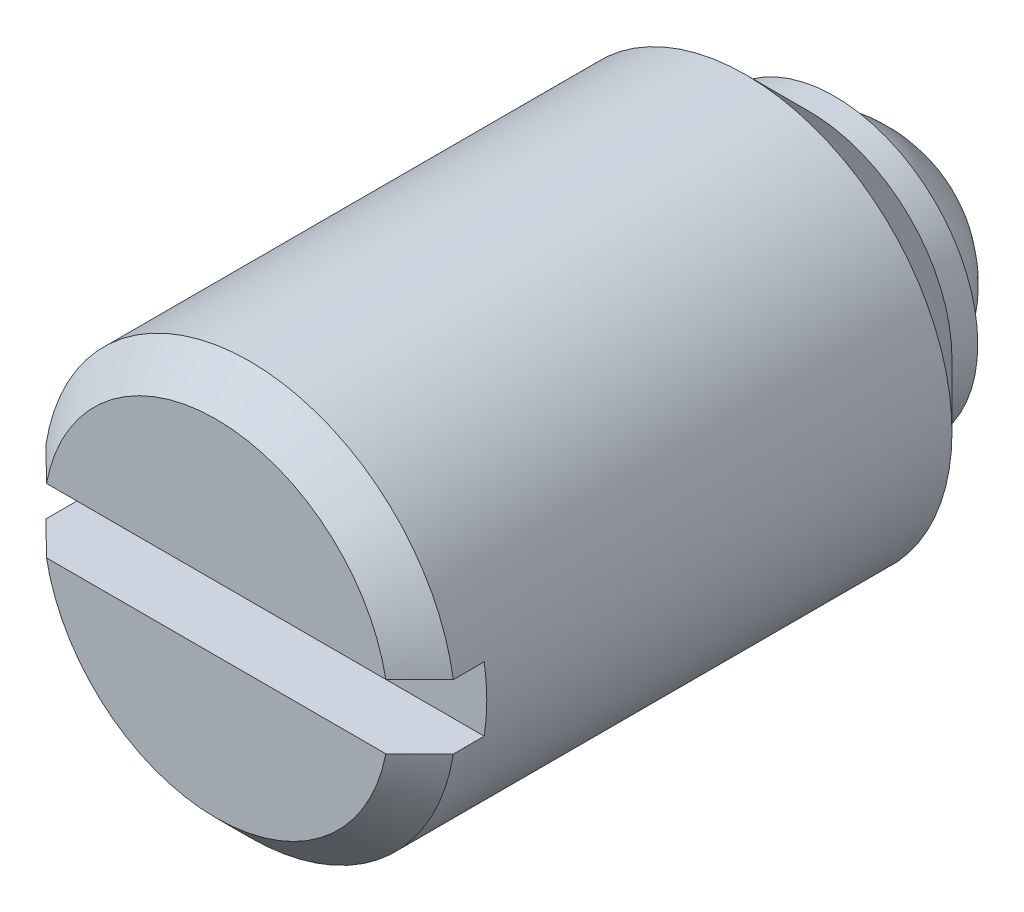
ISO-10303-21;
HEADER;
FILE_DESCRIPTION(('STEP AP214'),'2;1');
FILE_NAME('part.step','',(''),(''),'','','');
FILE_SCHEMA(('AUTOMOTIVE_DESIGN { 1 0 10303 214 1 1 1 1 }'));
ENDSEC;
DATA;
#1=APPLICATION_CONTEXT('core data for automotive mechanical design processes');
#2=APPLICATION_PROTOCOL_DEFINITION('international standard','automotive_design',2000,#1);
#3=PRODUCT_CONTEXT('',#1,'mechanical');
#4=PRODUCT('Part','Part','',(#3));
#5=PRODUCT_RELATED_PRODUCT_CATEGORY('part','',(#4));
#6=PRODUCT_DEFINITION_FORMATION('','',#4);
#7=PRODUCT_DEFINITION_CONTEXT('part definition',#1,'design');
#8=PRODUCT_DEFINITION('design','',#6,#7);
#9=PRODUCT_DEFINITION_SHAPE('','',#8);
#10=(LENGTH_UNIT() NAMED_UNIT(*) SI_UNIT(.MILLI.,.METRE.));
#11=(NAMED_UNIT(*) PLANE_ANGLE_UNIT() SI_UNIT($,.RADIAN.));
#12=(NAMED_UNIT(*) SI_UNIT($,.STERADIAN.) SOLID_ANGLE_UNIT());
#13=UNCERTAINTY_MEASURE_WITH_UNIT(LENGTH_MEASURE(1.E-05),#10,'distance_accuracy_value','');
#14=(GEOMETRIC_REPRESENTATION_CONTEXT(3) GLOBAL_UNCERTAINTY_ASSIGNED_CONTEXT((#13)) GLOBAL_UNIT_ASSIGNED_CONTEXT((#10,
#11,#12)) REPRESENTATION_CONTEXT('',''));
#15=CARTESIAN_POINT('',(0.,0.,0.));
#16=DIRECTION('',(0.,0.,1.));
#17=DIRECTION('',(1.,0.,0.));
#18=AXIS2_PLACEMENT_3D('',#15,#16,#17);
#19=CARTESIAN_POINT('',(0.,0.,-2.5));
#20=DIRECTION('',(0.,0.,-1.));
#21=DIRECTION('',(-1.,0.,0.));
#22=AXIS2_PLACEMENT_3D('',#19,#20,#21);
#23=CYLINDRICAL_SURFACE('',#22,8.);
#24=DIRECTION('',(0.,0.,1.));
#25=VECTOR('',#24,1.);
#26=CARTESIAN_POINT('',(7.90174031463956,-1.25,25.));
#27=LINE('',#26,#25);
#28=CARTESIAN_POINT('',(7.90174031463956,-1.25,25.));
#29=VERTEX_POINT('',#28);
#30=CARTESIAN_POINT('',(7.90174031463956,-1.25,26.2));
#31=VERTEX_POINT('',#30);
#32=EDGE_CURVE('E83',#29,#31,#27,.T.);
#33=ORIENTED_EDGE('',*,*,#32,.T.);
#34=CARTESIAN_POINT('',(0.,0.,26.2));
#35=DIRECTION('',(0.,0.,1.));
#36=DIRECTION('',(1.,0.,0.));
#37=AXIS2_PLACEMENT_3D('',#34,#35,#36);
#38=CIRCLE('',#37,8.);
#39=CARTESIAN_POINT('',(-7.90174031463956,-1.25,26.2));
#40=VERTEX_POINT('',#39);
#41=EDGE_CURVE('E89',#31,#40,#38,.F.);
#42=ORIENTED_EDGE('',*,*,#41,.T.);
#43=DIRECTION('',(0.,0.,1.));
#44=VECTOR('',#43,1.);
#45=CARTESIAN_POINT('',(-7.90174031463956,-1.25,25.));
#46=LINE('',#45,#44);
#47=CARTESIAN_POINT('',(-7.90174031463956,-1.25,25.));
#48=VERTEX_POINT('',#47);
#49=EDGE_CURVE('E81',#48,#40,#46,.T.);
#50=ORIENTED_EDGE('',*,*,#49,.F.);
#51=CARTESIAN_POINT('',(0.,0.,25.));
#52=DIRECTION('',(0.,0.,1.));
#53=DIRECTION('',(1.,0.,0.));
#54=AXIS2_PLACEMENT_3D('',#51,#52,#53);
#55=CIRCLE('',#54,8.);
#56=CARTESIAN_POINT('',(-7.90174031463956,1.25,25.));
#57=VERTEX_POINT('',#56);
#58=EDGE_CURVE('E65',#57,#48,#55,.T.);
#59=ORIENTED_EDGE('',*,*,#58,.F.);
#60=DIRECTION('',(0.,0.,1.));
#61=VECTOR('',#60,1.);
#62=CARTESIAN_POINT('',(-7.90174031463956,1.25,25.));
#63=LINE('',#62,#61);
#64=CARTESIAN_POINT('',(-7.90174031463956,1.25,26.2));
#65=VERTEX_POINT('',#64);
#66=EDGE_CURVE('E96',#57,#65,#63,.T.);
#67=ORIENTED_EDGE('',*,*,#66,.T.);
#68=CARTESIAN_POINT('',(0.,0.,26.2));
#69=DIRECTION('',(0.,0.,1.));
#70=DIRECTION('',(1.,0.,0.));
#71=AXIS2_PLACEMENT_3D('',#68,#69,#70);
#72=CIRCLE('',#71,8.);
#73=CARTESIAN_POINT('',(7.90174031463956,1.25,26.2));
#74=VERTEX_POINT('',#73);
#75=EDGE_CURVE('E101',#65,#74,#72,.F.);
#76=ORIENTED_EDGE('',*,*,#75,.T.);
#77=DIRECTION('',(0.,0.,1.));
#78=VECTOR('',#77,1.);
#79=CARTESIAN_POINT('',(7.90174031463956,1.25,25.));
#80=LINE('',#79,#78);
#81=CARTESIAN_POINT('',(7.90174031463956,1.25,25.));
#82=VERTEX_POINT('',#81);
#83=EDGE_CURVE('E91',#82,#74,#80,.T.);
#84=ORIENTED_EDGE('',*,*,#83,.F.);
#85=EDGE_CURVE('E77',#29,#82,#55,.T.);
#86=ORIENTED_EDGE('',*,*,#85,.F.);
#87=EDGE_LOOP('',(#33,#42,#50,#59,#67,#76,#84,#86));
#88=FACE_BOUND('',#87,.T.);
#89=CARTESIAN_POINT('',(0.,0.,6.95));
#90=DIRECTION('',(0.,0.,1.));
#91=DIRECTION('',(1.,0.,0.));
#92=AXIS2_PLACEMENT_3D('',#89,#90,#91);
#93=CIRCLE('',#92,8.);
#94=CARTESIAN_POINT('',(8.,0.,6.95));
#95=VERTEX_POINT('',#94);
#96=EDGE_CURVE('E165',#95,#95,#93,.T.);
#97=ORIENTED_EDGE('',*,*,#96,.T.);
#98=EDGE_LOOP('',(#97));
#99=FACE_BOUND('',#98,.T.);
#100=ADVANCED_FACE('F14',(#88,#99),#23,.T.);
#101=CARTESIAN_POINT('',(0.,8.,27.5));
#102=DIRECTION('',(0.,0.,1.));
#103=DIRECTION('',(1.,0.,0.));
#104=AXIS2_PLACEMENT_3D('',#101,#102,#103);
#105=PLANE('',#104);
#106=DIRECTION('',(1.,0.,0.));
#107=VECTOR('',#106,1.);
#108=CARTESIAN_POINT('',(-7.90174031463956,1.25,27.5));
#109=LINE('',#108,#107);
#110=CARTESIAN_POINT('',(-6.5823627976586,1.25,27.5));
#111=VERTEX_POINT('',#110);
#112=CARTESIAN_POINT('',(6.5823627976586,1.25,27.5));
#113=VERTEX_POINT('',#112);
#114=EDGE_CURVE('E75',#111,#113,#109,.T.);
#115=ORIENTED_EDGE('',*,*,#114,.T.);
#116=CARTESIAN_POINT('',(0.,0.,27.5));
#117=DIRECTION('',(0.,0.,1.));
#118=DIRECTION('',(1.,0.,0.));
#119=AXIS2_PLACEMENT_3D('',#116,#117,#118);
#120=CIRCLE('',#119,6.7);
#121=EDGE_CURVE('E9',#113,#111,#120,.T.);
#122=ORIENTED_EDGE('',*,*,#121,.T.);
#123=EDGE_LOOP('',(#115,#122));
#124=FACE_BOUND('',#123,.T.);
#125=ADVANCED_FACE('F182',(#124),#105,.T.);
#126=DIRECTION('',(1.,0.,0.));
#127=VECTOR('',#126,1.);
#128=CARTESIAN_POINT('',(-7.90174031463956,-1.25,27.5));
#129=LINE('',#128,#127);
#130=CARTESIAN_POINT('',(-6.5823627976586,-1.25,27.5));
#131=VERTEX_POINT('',#130);
#132=CARTESIAN_POINT('',(6.5823627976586,-1.25,27.5));
#133=VERTEX_POINT('',#132);
#134=EDGE_CURVE('E152',#131,#133,#129,.T.);
#135=ORIENTED_EDGE('',*,*,#134,.F.);
#136=CARTESIAN_POINT('',(0.,0.,27.5));
#137=DIRECTION('',(0.,0.,1.));
#138=DIRECTION('',(1.,0.,0.));
#139=AXIS2_PLACEMENT_3D('',#136,#137,#138);
#140=CIRCLE('',#139,6.7);
#141=EDGE_CURVE('E146',#131,#133,#140,.T.);
#142=ORIENTED_EDGE('',*,*,#141,.T.);
#143=EDGE_LOOP('',(#135,#142));
#144=FACE_BOUND('',#143,.T.);
#145=ADVANCED_FACE('F132',(#144),#105,.T.);
#146=CARTESIAN_POINT('',(-7.90174031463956,1.25,25.));
#147=DIRECTION('',(0.,-1.,0.));
#148=DIRECTION('',(1.,0.,0.));
#149=AXIS2_PLACEMENT_3D('',#146,#147,#148);
#150=PLANE('',#149);
#151=ORIENTED_EDGE('',*,*,#83,.T.);
#152=CARTESIAN_POINT('',(7.90174031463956,1.25,26.2));
#153=CARTESIAN_POINT('',(7.68210487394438,1.25,26.4169310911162));
#154=CARTESIAN_POINT('',(7.46236593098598,1.25,26.6337575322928));
#155=CARTESIAN_POINT('',(7.13254175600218,1.25,26.9587781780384));
#156=CARTESIAN_POINT('',(7.02256440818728,1.25,27.0670818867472));
#157=CARTESIAN_POINT('',(6.8025276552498,1.25,27.2836060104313));
#158=CARTESIAN_POINT('',(6.69246825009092,1.25,27.3918264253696));
#159=CARTESIAN_POINT('',(6.5823627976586,1.25,27.5));
#160=B_SPLINE_CURVE_WITH_KNOTS('',3,(#152,#153,#154,#155,#156,#157,#158,#159),.UNSPECIFIED.,.F.,
.F.,(4,2,2,4),(0.,0.926115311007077,1.38917293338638,1.85223076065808),.UNSPECIFIED.);
#161=EDGE_CURVE('E23',#74,#113,#160,.T.);
#162=ORIENTED_EDGE('',*,*,#161,.T.);
#163=ORIENTED_EDGE('',*,*,#114,.F.);
#164=CARTESIAN_POINT('',(-6.5823627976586,1.25,27.5));
#165=CARTESIAN_POINT('',(-6.69246825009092,1.25,27.3918264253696));
#166=CARTESIAN_POINT('',(-6.8025276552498,1.25,27.2836060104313));
#167=CARTESIAN_POINT('',(-7.02256440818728,1.25,27.0670818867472));
#168=CARTESIAN_POINT('',(-7.13254175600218,1.25,26.9587781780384));
#169=CARTESIAN_POINT('',(-7.46236593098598,1.25,26.6337575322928));
#170=CARTESIAN_POINT('',(-7.68210487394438,1.25,26.4169310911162));
#171=CARTESIAN_POINT('',(-7.90174031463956,1.25,26.2));
#172=B_SPLINE_CURVE_WITH_KNOTS('',3,(#164,#165,#166,#167,#168,#169,#170,#171),.UNSPECIFIED.,.F.,
.F.,(4,2,2,4),(0.,0.463057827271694,0.926115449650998,1.85223076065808),.UNSPECIFIED.);
#173=EDGE_CURVE('E137',#111,#65,#172,.T.);
#174=ORIENTED_EDGE('',*,*,#173,.T.);
#175=ORIENTED_EDGE('',*,*,#66,.F.);
#176=DIRECTION('',(1.,0.,0.));
#177=VECTOR('',#176,1.);
#178=CARTESIAN_POINT('',(-7.90174031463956,1.25,25.));
#179=LINE('',#178,#177);
#180=EDGE_CURVE('E71',#57,#82,#179,.T.);
#181=ORIENTED_EDGE('',*,*,#180,.T.);
#182=EDGE_LOOP('',(#151,#162,#163,#174,#175,#181));
#183=FACE_BOUND('',#182,.T.);
#184=ADVANCED_FACE('F125',(#183),#150,.T.);
#185=CARTESIAN_POINT('',(-7.90174031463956,-1.25,25.));
#186=DIRECTION('',(0.,-1.,0.));
#187=DIRECTION('',(1.,0.,0.));
#188=AXIS2_PLACEMENT_3D('',#185,#186,#187);
#189=PLANE('',#188);
#190=ORIENTED_EDGE('',*,*,#49,.T.);
#191=CARTESIAN_POINT('',(-7.90174031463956,-1.25,26.2));
#192=CARTESIAN_POINT('',(-7.68210487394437,-1.25,26.4169310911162));
#193=CARTESIAN_POINT('',(-7.46236593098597,-1.25,26.6337575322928));
#194=CARTESIAN_POINT('',(-7.13254175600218,-1.25,26.9587781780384));
#195=CARTESIAN_POINT('',(-7.02256440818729,-1.25,27.0670818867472));
#196=CARTESIAN_POINT('',(-6.8025276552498,-1.25,27.2836060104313));
#197=CARTESIAN_POINT('',(-6.69246825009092,-1.25,27.3918264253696));
#198=CARTESIAN_POINT('',(-6.5823627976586,-1.25,27.5));
#199=B_SPLINE_CURVE_WITH_KNOTS('',3,(#191,#192,#193,#194,#195,#196,#197,#198),.UNSPECIFIED.,.F.,
.F.,(4,2,2,4),(0.,0.926115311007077,1.38917293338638,1.85223076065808),.UNSPECIFIED.);
#200=EDGE_CURVE('E112',#40,#131,#199,.T.);
#201=ORIENTED_EDGE('',*,*,#200,.T.);
#202=ORIENTED_EDGE('',*,*,#134,.T.);
#203=CARTESIAN_POINT('',(6.5823627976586,-1.25,27.5));
#204=CARTESIAN_POINT('',(6.69246825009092,-1.25,27.3918264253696));
#205=CARTESIAN_POINT('',(6.8025276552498,-1.25,27.2836060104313));
#206=CARTESIAN_POINT('',(7.02256440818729,-1.25,27.0670818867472));
#207=CARTESIAN_POINT('',(7.13254175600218,-1.25,26.9587781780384));
#208=CARTESIAN_POINT('',(7.46236593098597,-1.25,26.6337575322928));
#209=CARTESIAN_POINT('',(7.68210487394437,-1.25,26.4169310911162));
#210=CARTESIAN_POINT('',(7.90174031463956,-1.25,26.2));
#211=B_SPLINE_CURVE_WITH_KNOTS('',3,(#203,#204,#205,#206,#207,#208,#209,#210),.UNSPECIFIED.,.F.,
.F.,(4,2,2,4),(0.,0.463057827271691,0.926115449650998,1.85223076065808),.UNSPECIFIED.);
#212=EDGE_CURVE('E105',#133,#31,#211,.T.);
#213=ORIENTED_EDGE('',*,*,#212,.T.);
#214=ORIENTED_EDGE('',*,*,#32,.F.);
#215=DIRECTION('',(1.,0.,0.));
#216=VECTOR('',#215,1.);
#217=CARTESIAN_POINT('',(-7.90174031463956,-1.25,25.));
#218=LINE('',#217,#216);
#219=EDGE_CURVE('E68',#48,#29,#218,.T.);
#220=ORIENTED_EDGE('',*,*,#219,.F.);
#221=EDGE_LOOP('',(#190,#201,#202,#213,#214,#220));
#222=FACE_BOUND('',#221,.T.);
#223=ADVANCED_FACE('F80',(#222),#189,.F.);
#224=CARTESIAN_POINT('',(0.,0.,25.));
#225=DIRECTION('',(0.,0.,1.));
#226=DIRECTION('',(1.,0.,0.));
#227=AXIS2_PLACEMENT_3D('',#224,#225,#226);
#228=PLANE('',#227);
#229=ORIENTED_EDGE('',*,*,#58,.T.);
#230=ORIENTED_EDGE('',*,*,#219,.T.);
#231=ORIENTED_EDGE('',*,*,#85,.T.);
#232=ORIENTED_EDGE('',*,*,#180,.F.);
#233=EDGE_LOOP('',(#229,#230,#231,#232));
#234=FACE_BOUND('',#233,.T.);
#235=ADVANCED_FACE('F67',(#234),#228,.T.);
#236=CARTESIAN_POINT('',(0.,0.,31.6025159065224));
#237=DIRECTION('',(0.,0.,1.));
#238=DIRECTION('',(1.,0.,0.));
#239=AXIS2_PLACEMENT_3D('',#236,#237,#238);
#240=CYLINDRICAL_SURFACE('',#239,5.55);
#241=CARTESIAN_POINT('',(0.,0.,3.5));
#242=DIRECTION('',(0.,0.,1.));
#243=DIRECTION('',(1.,0.,0.));
#244=AXIS2_PLACEMENT_3D('',#241,#242,#243);
#245=CIRCLE('',#244,5.55);
#246=CARTESIAN_POINT('',(5.55,0.,3.5));
#247=VERTEX_POINT('',#246);
#248=EDGE_CURVE('E155',#247,#247,#245,.T.);
#249=ORIENTED_EDGE('',*,*,#248,.T.);
#250=EDGE_LOOP('',(#249));
#251=FACE_BOUND('',#250,.T.);
#252=CARTESIAN_POINT('',(0.,0.,4.5));
#253=DIRECTION('',(0.,0.,1.));
#254=DIRECTION('',(1.,0.,0.));
#255=AXIS2_PLACEMENT_3D('',#252,#253,#254);
#256=CIRCLE('',#255,5.55);
#257=CARTESIAN_POINT('',(5.55,0.,4.5));
#258=VERTEX_POINT('',#257);
#259=EDGE_CURVE('E162',#258,#258,#256,.T.);
#260=ORIENTED_EDGE('',*,*,#259,.F.);
#261=EDGE_LOOP('',(#260));
#262=FACE_BOUND('',#261,.T.);
#263=ADVANCED_FACE('F126',(#251,#262),#240,.T.);
#264=CARTESIAN_POINT('',(0.,0.,6.95));
#265=DIRECTION('',(0.,0.,1.));
#266=DIRECTION('',(1.,0.,0.));
#267=AXIS2_PLACEMENT_3D('',#264,#265,#266);
#268=CONICAL_SURFACE('',#267,8.,0.785398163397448);
#269=ORIENTED_EDGE('',*,*,#259,.T.);
#270=EDGE_LOOP('',(#269));
#271=FACE_BOUND('',#270,.T.);
#272=ORIENTED_EDGE('',*,*,#96,.F.);
#273=EDGE_LOOP('',(#272));
#274=FACE_BOUND('',#273,.T.);
#275=ADVANCED_FACE('F169',(#271,#274),#268,.T.);
#276=CARTESIAN_POINT('',(0.,0.,5.));
#277=DIRECTION('',(-1.,0.,0.));
#278=DIRECTION('',(0.,0.,1.));
#279=AXIS2_PLACEMENT_3D('',#276,#277,#278);
#280=SPHERICAL_SURFACE('',#279,5.);
#281=CARTESIAN_POINT('',(0.,0.,5.));
#282=DIRECTION('',(0.,0.,-1.));
#283=DIRECTION('',(-1.,0.,0.));
#284=AXIS2_PLACEMENT_3D('',#281,#282,#283);
#285=SPHERICAL_SURFACE('',#284,5.);
#286=CARTESIAN_POINT('',(0.,0.,3.5));
#287=DIRECTION('',(0.,0.,-1.));
#288=DIRECTION('',(-1.,0.,0.));
#289=AXIS2_PLACEMENT_3D('',#286,#287,#288);
#290=CIRCLE('',#289,4.76969600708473);
#291=CARTESIAN_POINT('',(-4.76969600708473,0.,3.5));
#292=VERTEX_POINT('',#291);
#293=EDGE_CURVE('E98',#292,#292,#290,.T.);
#294=ORIENTED_EDGE('',*,*,#293,.T.);
#295=EDGE_LOOP('',(#294));
#296=FACE_BOUND('',#295,.T.);
#297=ADVANCED_FACE('F171',(#296),#285,.T.);
#298=CARTESIAN_POINT('',(0.,4.76969600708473,3.5));
#299=DIRECTION('',(0.,0.,-1.));
#300=DIRECTION('',(-1.,0.,0.));
#301=AXIS2_PLACEMENT_3D('',#298,#299,#300);
#302=PLANE('',#301);
#303=ORIENTED_EDGE('',*,*,#293,.F.);
#304=EDGE_LOOP('',(#303));
#305=FACE_BOUND('',#304,.T.);
#306=ORIENTED_EDGE('',*,*,#248,.F.);
#307=EDGE_LOOP('',(#306));
#308=FACE_BOUND('',#307,.T.);
#309=ADVANCED_FACE('F133',(#305,#308),#302,.T.);
#310=CARTESIAN_POINT('',(0.,0.,26.2));
#311=DIRECTION('',(0.,0.,-1.));
#312=DIRECTION('',(-1.,0.,0.));
#313=AXIS2_PLACEMENT_3D('',#310,#311,#312);
#314=CONICAL_SURFACE('',#313,8.,0.785398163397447);
#315=ORIENTED_EDGE('',*,*,#212,.F.);
#316=ORIENTED_EDGE('',*,*,#141,.F.);
#317=ORIENTED_EDGE('',*,*,#200,.F.);
#318=ORIENTED_EDGE('',*,*,#41,.F.);
#319=EDGE_LOOP('',(#315,#316,#317,#318));
#320=FACE_BOUND('',#319,.T.);
#321=ADVANCED_FACE('F118',(#320),#314,.T.);
#322=CARTESIAN_POINT('',(0.,0.,26.2));
#323=DIRECTION('',(0.,0.,-1.));
#324=DIRECTION('',(-1.,0.,0.));
#325=AXIS2_PLACEMENT_3D('',#322,#323,#324);
#326=CONICAL_SURFACE('',#325,8.,0.785398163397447);
#327=ORIENTED_EDGE('',*,*,#173,.F.);
#328=ORIENTED_EDGE('',*,*,#121,.F.);
#329=ORIENTED_EDGE('',*,*,#161,.F.);
#330=ORIENTED_EDGE('',*,*,#75,.F.);
#331=EDGE_LOOP('',(#327,#328,#329,#330));
#332=FACE_BOUND('',#331,.T.);
#333=ADVANCED_FACE('F16',(#332),#326,.T.);
#334=CLOSED_SHELL('',(#100,#125,#145,#184,#223,#235,#263,#275,#297,#309,#321,#333));
#335=MANIFOLD_SOLID_BREP('B1',#334);
#336=ADVANCED_BREP_SHAPE_REPRESENTATION('',(#18,#335),#14);
#337=SHAPE_DEFINITION_REPRESENTATION(#9,#336);
ENDSEC;
END-ISO-10303-21;
